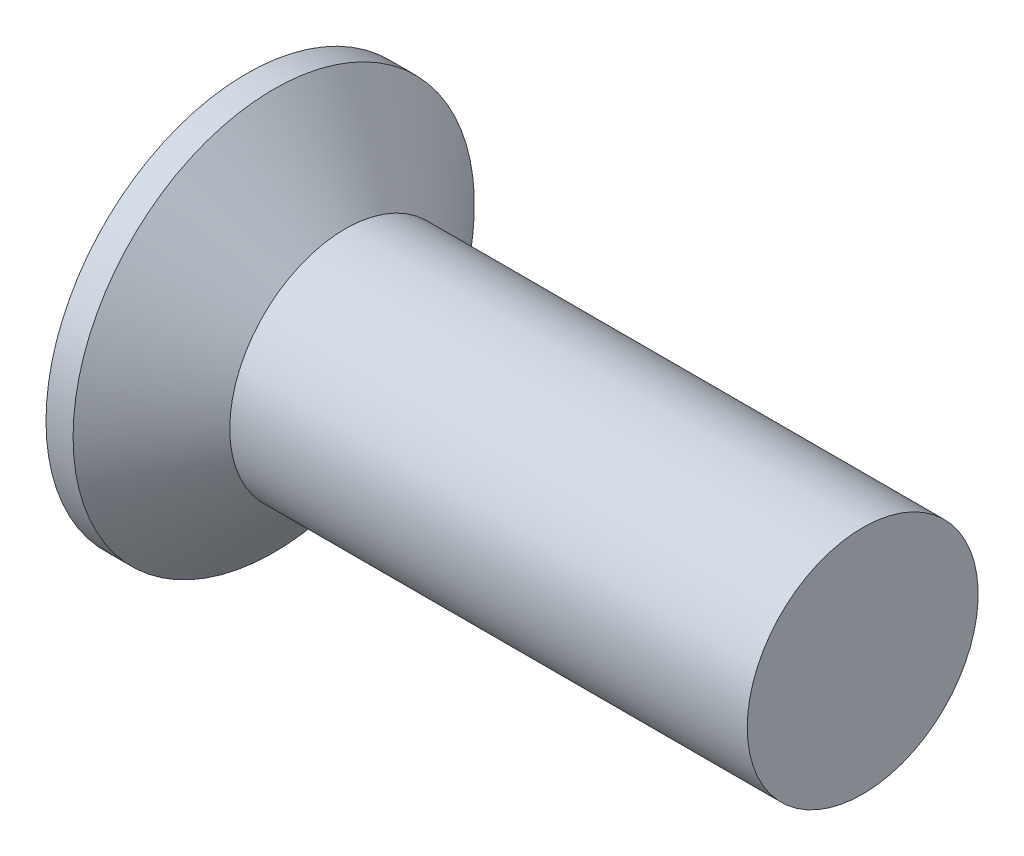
from build123d import *

# Parameters (mm, degrees)
CIRPATTERN1_COUNT = 2
CIRPATTERN1_ANGLE = 90


with BuildPart() as part:
    # BodySke → Base-Revolve (revolve)
    with BuildSketch(Plane.XY, mode=Mode.PRIVATE) as base_revolve_sk:
        Polygon((0, 0), (0, 3.6195), (0.488555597, 3.6195), (1.778, 2.0828), (11.1125, 2.0828), (11.1125, 0), align=None)
    revolve(base_revolve_sk.sketch.rotate(Axis((-6.35, 0, 0), (1, 0, 0)), 90), axis=Axis((-6.35, 0, 0), (1, 0, 0)))

    # Sketch3 → Cross section 0
    with BuildSketch(Plane.ZY):
        with BuildLine():
            Line((-0.4699, 2.4257), (0.4699, 2.4257))
            Line((0.4699, 2.4257), (0.4699, -2.4257))
            Line((0.4699, -2.4257), (-0.4699, -2.4257))
            Line((-0.4699, -2.4257), (-0.4699, 2.4257))
        make_face()
    # Sketch4 → Cross section 1
    with BuildSketch(Plane.ZY.offset(-3.1496)):
        with BuildLine():
            Line((-0.23495, 0.23495), (0.23495, 0.23495))
            Line((0.23495, 0.23495), (0.23495, -0.23495))
            Line((0.23495, -0.23495), (-0.23495, -0.23495))
            Line((-0.23495, -0.23495), (-0.23495, 0.23495))
        make_face()
    cross = loft(mode=Mode.SUBTRACT)

    # CirPattern1: Cross ×2 about axis
    cirpattern1_axis = Axis((0, 0, 0), (1, 0, 0))
    for i in range(1, CIRPATTERN1_COUNT):
        add(cross.rotate(cirpattern1_axis, i * CIRPATTERN1_ANGLE / (CIRPATTERN1_COUNT - 1)), mode=Mode.SUBTRACT)


solid = part.part
